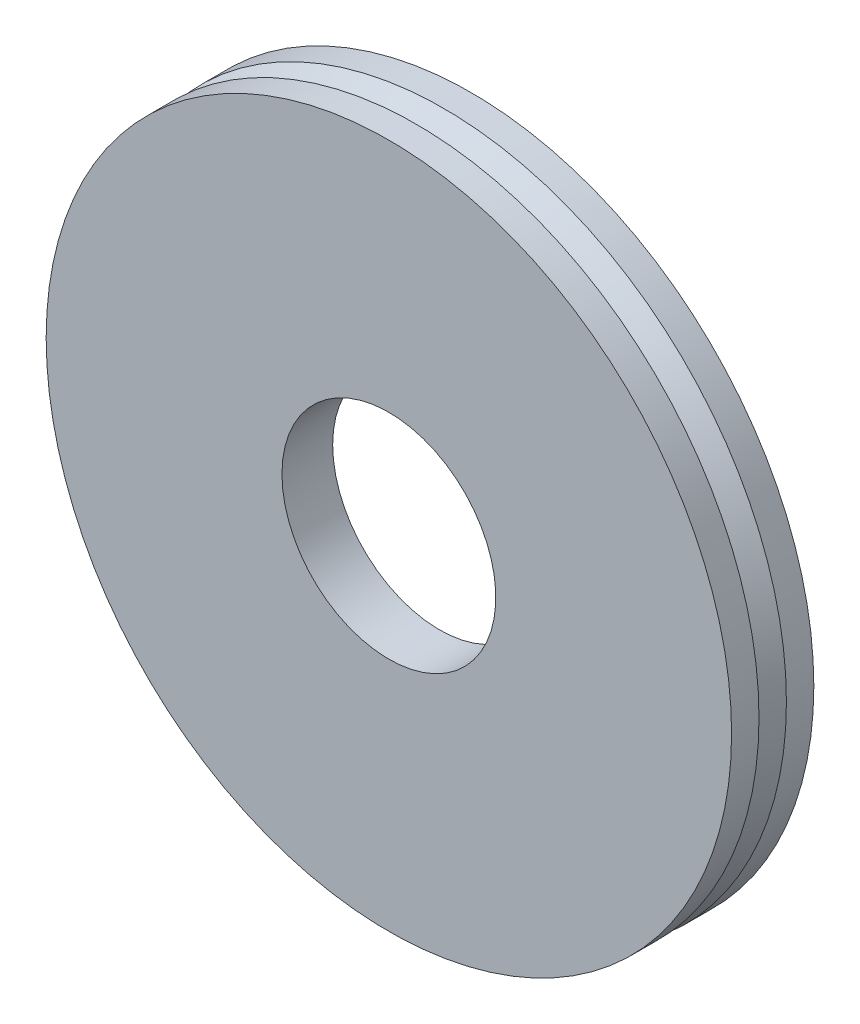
ISO-10303-21;
HEADER;
FILE_DESCRIPTION(('STEP AP214'),'2;1');
FILE_NAME('part.step','',(''),(''),'','','');
FILE_SCHEMA(('AUTOMOTIVE_DESIGN { 1 0 10303 214 1 1 1 1 }'));
ENDSEC;
DATA;
#1=APPLICATION_CONTEXT('core data for automotive mechanical design processes');
#2=APPLICATION_PROTOCOL_DEFINITION('international standard','automotive_design',2000,#1);
#3=PRODUCT_CONTEXT('',#1,'mechanical');
#4=PRODUCT('Part','Part','',(#3));
#5=PRODUCT_RELATED_PRODUCT_CATEGORY('part','',(#4));
#6=PRODUCT_DEFINITION_FORMATION('','',#4);
#7=PRODUCT_DEFINITION_CONTEXT('part definition',#1,'design');
#8=PRODUCT_DEFINITION('design','',#6,#7);
#9=PRODUCT_DEFINITION_SHAPE('','',#8);
#10=(LENGTH_UNIT() NAMED_UNIT(*) SI_UNIT(.MILLI.,.METRE.));
#11=(NAMED_UNIT(*) PLANE_ANGLE_UNIT() SI_UNIT($,.RADIAN.));
#12=(NAMED_UNIT(*) SI_UNIT($,.STERADIAN.) SOLID_ANGLE_UNIT());
#13=UNCERTAINTY_MEASURE_WITH_UNIT(LENGTH_MEASURE(1.E-05),#10,'distance_accuracy_value','');
#14=(GEOMETRIC_REPRESENTATION_CONTEXT(3) GLOBAL_UNCERTAINTY_ASSIGNED_CONTEXT((#13)) GLOBAL_UNIT_ASSIGNED_CONTEXT((#10,
#11,#12)) REPRESENTATION_CONTEXT('',''));
#15=CARTESIAN_POINT('',(0.,0.,0.));
#16=DIRECTION('',(0.,0.,1.));
#17=DIRECTION('',(1.,0.,0.));
#18=AXIS2_PLACEMENT_3D('',#15,#16,#17);
#19=CARTESIAN_POINT('',(0.,0.,0.));
#20=DIRECTION('',(0.,0.,-1.));
#21=DIRECTION('',(-1.,0.,0.));
#22=AXIS2_PLACEMENT_3D('',#19,#20,#21);
#23=CYLINDRICAL_SURFACE('',#22,3.9);
#24=CARTESIAN_POINT('',(0.,0.,-1.85));
#25=DIRECTION('',(0.,0.,-1.));
#26=DIRECTION('',(-1.,0.,0.));
#27=AXIS2_PLACEMENT_3D('',#24,#25,#26);
#28=CIRCLE('',#27,3.9);
#29=CARTESIAN_POINT('',(-3.9,0.,-1.85));
#30=VERTEX_POINT('',#29);
#31=EDGE_CURVE('E60',#30,#30,#28,.T.);
#32=ORIENTED_EDGE('',*,*,#31,.T.);
#33=EDGE_LOOP('',(#32));
#34=FACE_BOUND('',#33,.T.);
#35=CARTESIAN_POINT('',(0.,0.,0.));
#36=DIRECTION('',(0.,0.,-1.));
#37=DIRECTION('',(-1.,0.,0.));
#38=AXIS2_PLACEMENT_3D('',#35,#36,#37);
#39=CIRCLE('',#38,3.9);
#40=CARTESIAN_POINT('',(-3.9,0.,0.));
#41=VERTEX_POINT('',#40);
#42=EDGE_CURVE('E10',#41,#41,#39,.T.);
#43=ORIENTED_EDGE('',*,*,#42,.F.);
#44=EDGE_LOOP('',(#43));
#45=FACE_BOUND('',#44,.T.);
#46=ADVANCED_FACE('F29',(#34,#45),#23,.F.);
#47=CARTESIAN_POINT('',(0.,3.9,0.));
#48=DIRECTION('',(0.,0.,1.));
#49=DIRECTION('',(1.,0.,0.));
#50=AXIS2_PLACEMENT_3D('',#47,#48,#49);
#51=PLANE('',#50);
#52=ORIENTED_EDGE('',*,*,#42,.T.);
#53=EDGE_LOOP('',(#52));
#54=FACE_BOUND('',#53,.T.);
#55=CARTESIAN_POINT('',(0.,0.,0.));
#56=DIRECTION('',(0.,0.,-1.));
#57=DIRECTION('',(-1.,0.,0.));
#58=AXIS2_PLACEMENT_3D('',#55,#56,#57);
#59=CIRCLE('',#58,12.5);
#60=CARTESIAN_POINT('',(-12.5,0.,0.));
#61=VERTEX_POINT('',#60);
#62=EDGE_CURVE('E35',#61,#61,#59,.T.);
#63=ORIENTED_EDGE('',*,*,#62,.F.);
#64=EDGE_LOOP('',(#63));
#65=FACE_BOUND('',#64,.T.);
#66=ADVANCED_FACE('F78',(#54,#65),#51,.T.);
#67=CARTESIAN_POINT('',(0.,0.,0.));
#68=DIRECTION('',(0.,0.,-1.));
#69=DIRECTION('',(-1.,0.,0.));
#70=AXIS2_PLACEMENT_3D('',#67,#68,#69);
#71=CYLINDRICAL_SURFACE('',#70,12.5);
#72=ORIENTED_EDGE('',*,*,#62,.T.);
#73=EDGE_LOOP('',(#72));
#74=FACE_BOUND('',#73,.T.);
#75=CARTESIAN_POINT('',(0.,0.,-1.));
#76=DIRECTION('',(0.,0.,-1.));
#77=DIRECTION('',(-1.,0.,0.));
#78=AXIS2_PLACEMENT_3D('',#75,#76,#77);
#79=CIRCLE('',#78,12.5);
#80=CARTESIAN_POINT('',(-12.5,0.,-1.));
#81=VERTEX_POINT('',#80);
#82=EDGE_CURVE('E39',#81,#81,#79,.T.);
#83=ORIENTED_EDGE('',*,*,#82,.F.);
#84=EDGE_LOOP('',(#83));
#85=FACE_BOUND('',#84,.T.);
#86=ADVANCED_FACE('F82',(#74,#85),#71,.T.);
#87=CARTESIAN_POINT('',(0.,12.5,-1.));
#88=DIRECTION('',(0.,0.,-1.));
#89=DIRECTION('',(-1.,0.,0.));
#90=AXIS2_PLACEMENT_3D('',#87,#88,#89);
#91=PLANE('',#90);
#92=ORIENTED_EDGE('',*,*,#82,.T.);
#93=EDGE_LOOP('',(#92));
#94=FACE_BOUND('',#93,.T.);
#95=CARTESIAN_POINT('',(0.,0.,-1.));
#96=DIRECTION('',(0.,0.,-1.));
#97=DIRECTION('',(-1.,0.,0.));
#98=AXIS2_PLACEMENT_3D('',#95,#96,#97);
#99=CIRCLE('',#98,12.);
#100=CARTESIAN_POINT('',(-12.,0.,-1.));
#101=VERTEX_POINT('',#100);
#102=EDGE_CURVE('E43',#101,#101,#99,.T.);
#103=ORIENTED_EDGE('',*,*,#102,.F.);
#104=EDGE_LOOP('',(#103));
#105=FACE_BOUND('',#104,.T.);
#106=ADVANCED_FACE('F86',(#94,#105),#91,.T.);
#107=CARTESIAN_POINT('',(0.,0.,-2.));
#108=DIRECTION('',(0.,0.,-1.));
#109=DIRECTION('',(-1.,0.,0.));
#110=AXIS2_PLACEMENT_3D('',#107,#108,#109);
#111=CONICAL_SURFACE('',#110,12.5,0.463647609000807);
#112=ORIENTED_EDGE('',*,*,#102,.T.);
#113=EDGE_LOOP('',(#112));
#114=FACE_BOUND('',#113,.T.);
#115=CARTESIAN_POINT('',(0.,0.,-2.));
#116=DIRECTION('',(0.,0.,-1.));
#117=DIRECTION('',(-1.,0.,0.));
#118=AXIS2_PLACEMENT_3D('',#115,#116,#117);
#119=CIRCLE('',#118,12.5);
#120=CARTESIAN_POINT('',(-12.5,0.,-2.));
#121=VERTEX_POINT('',#120);
#122=EDGE_CURVE('E48',#121,#121,#119,.T.);
#123=ORIENTED_EDGE('',*,*,#122,.F.);
#124=EDGE_LOOP('',(#123));
#125=FACE_BOUND('',#124,.T.);
#126=ADVANCED_FACE('F92',(#114,#125),#111,.T.);
#127=CARTESIAN_POINT('',(0.,0.,0.));
#128=DIRECTION('',(0.,0.,-1.));
#129=DIRECTION('',(-1.,0.,0.));
#130=AXIS2_PLACEMENT_3D('',#127,#128,#129);
#131=CYLINDRICAL_SURFACE('',#130,12.5);
#132=ORIENTED_EDGE('',*,*,#122,.T.);
#133=EDGE_LOOP('',(#132));
#134=FACE_BOUND('',#133,.T.);
#135=CARTESIAN_POINT('',(0.,0.,-3.));
#136=DIRECTION('',(0.,0.,-1.));
#137=DIRECTION('',(-1.,0.,0.));
#138=AXIS2_PLACEMENT_3D('',#135,#136,#137);
#139=CIRCLE('',#138,12.5);
#140=CARTESIAN_POINT('',(-12.5,0.,-3.));
#141=VERTEX_POINT('',#140);
#142=EDGE_CURVE('E51',#141,#141,#139,.T.);
#143=ORIENTED_EDGE('',*,*,#142,.F.);
#144=EDGE_LOOP('',(#143));
#145=FACE_BOUND('',#144,.T.);
#146=ADVANCED_FACE('F96',(#134,#145),#131,.T.);
#147=CARTESIAN_POINT('',(0.,12.5,-3.));
#148=DIRECTION('',(0.,0.,-1.));
#149=DIRECTION('',(-1.,0.,0.));
#150=AXIS2_PLACEMENT_3D('',#147,#148,#149);
#151=PLANE('',#150);
#152=ORIENTED_EDGE('',*,*,#142,.T.);
#153=EDGE_LOOP('',(#152));
#154=FACE_BOUND('',#153,.T.);
#155=CARTESIAN_POINT('',(0.,0.,-3.));
#156=DIRECTION('',(0.,0.,-1.));
#157=DIRECTION('',(-1.,0.,0.));
#158=AXIS2_PLACEMENT_3D('',#155,#156,#157);
#159=CIRCLE('',#158,5.9);
#160=CARTESIAN_POINT('',(-5.9,0.,-3.));
#161=VERTEX_POINT('',#160);
#162=EDGE_CURVE('E54',#161,#161,#159,.T.);
#163=ORIENTED_EDGE('',*,*,#162,.F.);
#164=EDGE_LOOP('',(#163));
#165=FACE_BOUND('',#164,.T.);
#166=ADVANCED_FACE('F74',(#154,#165),#151,.T.);
#167=CARTESIAN_POINT('',(0.,0.,0.));
#168=DIRECTION('',(0.,0.,-1.));
#169=DIRECTION('',(-1.,0.,0.));
#170=AXIS2_PLACEMENT_3D('',#167,#168,#169);
#171=CYLINDRICAL_SURFACE('',#170,5.9);
#172=ORIENTED_EDGE('',*,*,#162,.T.);
#173=EDGE_LOOP('',(#172));
#174=FACE_BOUND('',#173,.T.);
#175=CARTESIAN_POINT('',(0.,0.,-1.85));
#176=DIRECTION('',(0.,0.,-1.));
#177=DIRECTION('',(-1.,0.,0.));
#178=AXIS2_PLACEMENT_3D('',#175,#176,#177);
#179=CIRCLE('',#178,5.9);
#180=CARTESIAN_POINT('',(-5.9,0.,-1.85));
#181=VERTEX_POINT('',#180);
#182=EDGE_CURVE('E57',#181,#181,#179,.T.);
#183=ORIENTED_EDGE('',*,*,#182,.F.);
#184=EDGE_LOOP('',(#183));
#185=FACE_BOUND('',#184,.T.);
#186=ADVANCED_FACE('F68',(#174,#185),#171,.F.);
#187=CARTESIAN_POINT('',(0.,3.9,-1.85));
#188=DIRECTION('',(0.,0.,-1.));
#189=DIRECTION('',(-1.,0.,0.));
#190=AXIS2_PLACEMENT_3D('',#187,#188,#189);
#191=PLANE('',#190);
#192=ORIENTED_EDGE('',*,*,#182,.T.);
#193=EDGE_LOOP('',(#192));
#194=FACE_BOUND('',#193,.T.);
#195=ORIENTED_EDGE('',*,*,#31,.F.);
#196=EDGE_LOOP('',(#195));
#197=FACE_BOUND('',#196,.T.);
#198=ADVANCED_FACE('F66',(#194,#197),#191,.T.);
#199=CLOSED_SHELL('',(#46,#66,#86,#106,#126,#146,#166,#186,#198));
#200=MANIFOLD_SOLID_BREP('B2',#199);
#201=ADVANCED_BREP_SHAPE_REPRESENTATION('',(#18,#200),#14);
#202=SHAPE_DEFINITION_REPRESENTATION(#9,#201);
ENDSEC;
END-ISO-10303-21;
